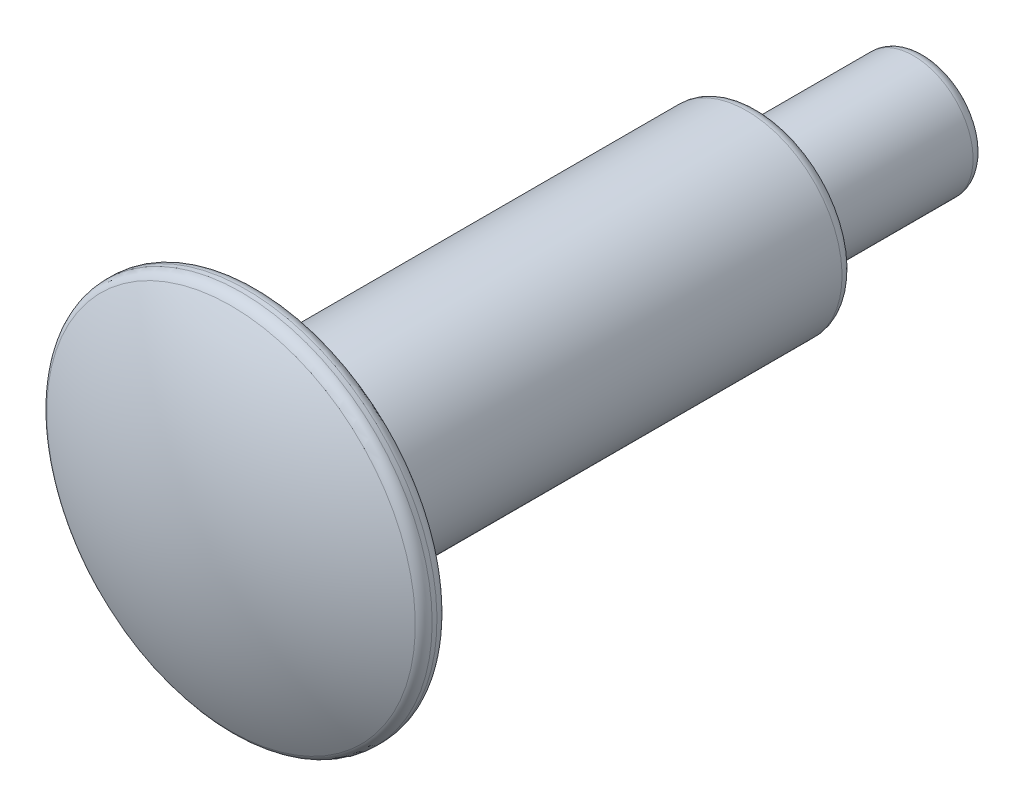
from build123d import *

# Parameters (mm, degrees)
FILLET_1_R = 0.5


with BuildPart() as part:
    # Sketch 1 → Revolve 1 (revolve)
    with BuildSketch(Plane(origin=(0, 0, 0), x_dir=(0, 0, -1), z_dir=(1, 0, 0)), mode=Mode.PRIVATE) as revolve_1_sk:
        with BuildLine():
            Line((-15.534565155, 0), (15.534565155, 0))
            Line((15.534565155, 0), (15.534565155, 2.5))
            Line((15.534565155, 2.5), (8.534565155, 2.5))
            Line((8.534565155, 2.5), (8.534565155, 4))
            Line((8.534565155, 4), (-12.465434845, 4))
            Line((-12.465434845, 4), (-12.465434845, 8))
            Line((-12.465434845, 8), (-13.465434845, 8))
            ThreePointArc((-13.465434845, 8), (-15.008909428, 4.13162499), (-15.534565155, 0))
        make_face()
    revolve(revolve_1_sk.sketch.rotate(Axis((0, 0, 15.534565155), (0, 0, -1)), 180), axis=Axis((0, 0, 15.534565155), (0, 0, -1)))

    # Fillet 1
    fillet_1_edges = [part.edges().sort_by_distance(p)[0] for p in [
        (0, 8, 13.465434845),
        (0, 8, 12.465434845),
        (0, 4, 12.465434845),
        (0, 4, -8.534565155),
        (0, 2.5, -8.534565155),
        (0, 2.5, -15.534565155),
    ]]
    fillet(fillet_1_edges, radius=FILLET_1_R)


solid = part.part
